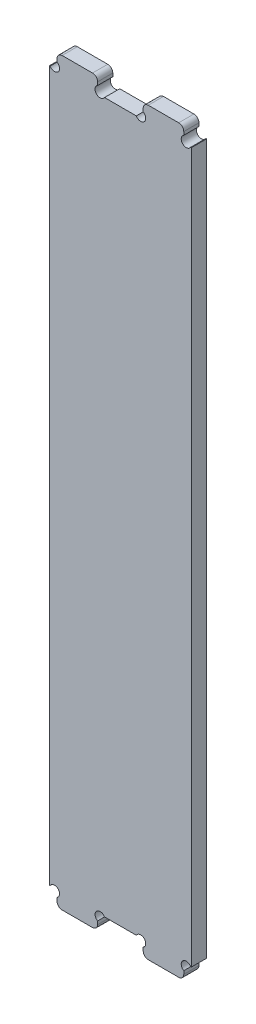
ISO-10303-21;
HEADER;
FILE_DESCRIPTION(('STEP AP214'),'2;1');
FILE_NAME('part.step','',(''),(''),'','','');
FILE_SCHEMA(('AUTOMOTIVE_DESIGN { 1 0 10303 214 1 1 1 1 }'));
ENDSEC;
DATA;
#1=APPLICATION_CONTEXT('core data for automotive mechanical design processes');
#2=APPLICATION_PROTOCOL_DEFINITION('international standard','automotive_design',2000,#1);
#3=PRODUCT_CONTEXT('',#1,'mechanical');
#4=PRODUCT('Part','Part','',(#3));
#5=PRODUCT_RELATED_PRODUCT_CATEGORY('part','',(#4));
#6=PRODUCT_DEFINITION_FORMATION('','',#4);
#7=PRODUCT_DEFINITION_CONTEXT('part definition',#1,'design');
#8=PRODUCT_DEFINITION('design','',#6,#7);
#9=PRODUCT_DEFINITION_SHAPE('','',#8);
#10=(LENGTH_UNIT() NAMED_UNIT(*) SI_UNIT(.MILLI.,.METRE.));
#11=(NAMED_UNIT(*) PLANE_ANGLE_UNIT() SI_UNIT($,.RADIAN.));
#12=(NAMED_UNIT(*) SI_UNIT($,.STERADIAN.) SOLID_ANGLE_UNIT());
#13=UNCERTAINTY_MEASURE_WITH_UNIT(LENGTH_MEASURE(1.E-05),#10,'distance_accuracy_value','');
#14=(GEOMETRIC_REPRESENTATION_CONTEXT(3) GLOBAL_UNCERTAINTY_ASSIGNED_CONTEXT((#13)) GLOBAL_UNIT_ASSIGNED_CONTEXT((#10,
#11,#12)) REPRESENTATION_CONTEXT('',''));
#15=CARTESIAN_POINT('',(0.,0.,0.));
#16=DIRECTION('',(0.,0.,1.));
#17=DIRECTION('',(1.,0.,0.));
#18=AXIS2_PLACEMENT_3D('',#15,#16,#17);
#19=CARTESIAN_POINT('',(0.,0.,3.));
#20=DIRECTION('',(0.,0.,-1.));
#21=DIRECTION('',(-1.,0.,0.));
#22=AXIS2_PLACEMENT_3D('',#19,#20,#21);
#23=PLANE('',#22);
#24=DIRECTION('',(1.,0.,0.));
#25=VECTOR('',#24,1.);
#26=CARTESIAN_POINT('',(12.5,-73.,3.));
#27=LINE('',#26,#25);
#28=CARTESIAN_POINT('',(5.5,-73.,3.));
#29=VERTEX_POINT('',#28);
#30=CARTESIAN_POINT('',(11.5,-73.,3.));
#31=VERTEX_POINT('',#30);
#32=EDGE_CURVE('E601',#29,#31,#27,.T.);
#33=ORIENTED_EDGE('',*,*,#32,.T.);
#34=CARTESIAN_POINT('',(11.5,-72.,3.));
#35=DIRECTION('',(0.,0.,-1.));
#36=DIRECTION('',(-1.,0.,0.));
#37=AXIS2_PLACEMENT_3D('',#34,#35,#36);
#38=CIRCLE('',#37,1.);
#39=CARTESIAN_POINT('',(12.5,-72.,3.));
#40=VERTEX_POINT('',#39);
#41=EDGE_CURVE('E382',#31,#40,#38,.F.);
#42=ORIENTED_EDGE('',*,*,#41,.T.);
#43=DIRECTION('',(0.,1.,0.));
#44=VECTOR('',#43,1.);
#45=CARTESIAN_POINT('',(12.5,-70.,3.));
#46=LINE('',#45,#44);
#47=CARTESIAN_POINT('',(12.5,-71.3660254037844,3.));
#48=VERTEX_POINT('',#47);
#49=EDGE_CURVE('E591',#40,#48,#46,.T.);
#50=ORIENTED_EDGE('',*,*,#49,.T.);
#51=CARTESIAN_POINT('',(13.,-70.5,3.));
#52=DIRECTION('',(0.,0.,1.));
#53=DIRECTION('',(1.,0.,0.));
#54=AXIS2_PLACEMENT_3D('',#51,#52,#53);
#55=CIRCLE('',#54,0.999999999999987);
#56=CARTESIAN_POINT('',(13.8660254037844,-70.,3.));
#57=VERTEX_POINT('',#56);
#58=EDGE_CURVE('E555',#57,#48,#55,.T.);
#59=ORIENTED_EDGE('',*,*,#58,.F.);
#60=DIRECTION('',(1.,0.,0.));
#61=VECTOR('',#60,1.);
#62=CARTESIAN_POINT('',(-14.,-70.,3.));
#63=LINE('',#62,#61);
#64=CARTESIAN_POINT('',(14.,-70.,3.));
#65=VERTEX_POINT('',#64);
#66=EDGE_CURVE('E320',#57,#65,#63,.T.);
#67=ORIENTED_EDGE('',*,*,#66,.T.);
#68=DIRECTION('',(0.,1.,0.));
#69=VECTOR('',#68,1.);
#70=CARTESIAN_POINT('',(14.,-70.,3.));
#71=LINE('',#70,#69);
#72=CARTESIAN_POINT('',(14.,70.,3.));
#73=VERTEX_POINT('',#72);
#74=EDGE_CURVE('E309',#65,#73,#71,.T.);
#75=ORIENTED_EDGE('',*,*,#74,.T.);
#76=DIRECTION('',(-1.,0.,0.));
#77=VECTOR('',#76,1.);
#78=CARTESIAN_POINT('',(-14.,70.,3.));
#79=LINE('',#78,#77);
#80=CARTESIAN_POINT('',(13.8660254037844,70.,3.));
#81=VERTEX_POINT('',#80);
#82=EDGE_CURVE('E314',#73,#81,#79,.T.);
#83=ORIENTED_EDGE('',*,*,#82,.T.);
#84=CARTESIAN_POINT('',(13.,70.5,3.));
#85=DIRECTION('',(0.,0.,1.));
#86=DIRECTION('',(1.,0.,0.));
#87=AXIS2_PLACEMENT_3D('',#84,#85,#86);
#88=CIRCLE('',#87,0.999999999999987);
#89=CARTESIAN_POINT('',(12.5,71.3660254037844,3.));
#90=VERTEX_POINT('',#89);
#91=EDGE_CURVE('E640',#90,#81,#88,.T.);
#92=ORIENTED_EDGE('',*,*,#91,.F.);
#93=DIRECTION('',(0.,1.,0.));
#94=VECTOR('',#93,1.);
#95=CARTESIAN_POINT('',(12.5,70.,3.));
#96=LINE('',#95,#94);
#97=CARTESIAN_POINT('',(12.5,72.,3.));
#98=VERTEX_POINT('',#97);
#99=EDGE_CURVE('E522',#90,#98,#96,.T.);
#100=ORIENTED_EDGE('',*,*,#99,.T.);
#101=CARTESIAN_POINT('',(11.5,72.,3.));
#102=DIRECTION('',(0.,0.,-1.));
#103=DIRECTION('',(-1.,0.,0.));
#104=AXIS2_PLACEMENT_3D('',#101,#102,#103);
#105=CIRCLE('',#104,1.);
#106=CARTESIAN_POINT('',(11.5,73.,3.));
#107=VERTEX_POINT('',#106);
#108=EDGE_CURVE('E374',#98,#107,#105,.F.);
#109=ORIENTED_EDGE('',*,*,#108,.T.);
#110=DIRECTION('',(-1.,0.,0.));
#111=VECTOR('',#110,1.);
#112=CARTESIAN_POINT('',(12.5,73.,3.));
#113=LINE('',#112,#111);
#114=CARTESIAN_POINT('',(5.5,73.,3.));
#115=VERTEX_POINT('',#114);
#116=EDGE_CURVE('E525',#107,#115,#113,.T.);
#117=ORIENTED_EDGE('',*,*,#116,.T.);
#118=CARTESIAN_POINT('',(5.5,72.,3.));
#119=DIRECTION('',(0.,0.,-1.));
#120=DIRECTION('',(-1.,0.,0.));
#121=AXIS2_PLACEMENT_3D('',#118,#119,#120);
#122=CIRCLE('',#121,1.);
#123=CARTESIAN_POINT('',(4.5,72.,3.));
#124=VERTEX_POINT('',#123);
#125=EDGE_CURVE('E372',#115,#124,#122,.F.);
#126=ORIENTED_EDGE('',*,*,#125,.T.);
#127=DIRECTION('',(0.,-1.,0.));
#128=VECTOR('',#127,1.);
#129=CARTESIAN_POINT('',(4.5,70.,3.));
#130=LINE('',#129,#128);
#131=CARTESIAN_POINT('',(4.5,71.3660254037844,3.));
#132=VERTEX_POINT('',#131);
#133=EDGE_CURVE('E518',#124,#132,#130,.T.);
#134=ORIENTED_EDGE('',*,*,#133,.T.);
#135=CARTESIAN_POINT('',(4.,70.5,3.));
#136=DIRECTION('',(0.,0.,1.));
#137=DIRECTION('',(1.,0.,0.));
#138=AXIS2_PLACEMENT_3D('',#135,#136,#137);
#139=CIRCLE('',#138,0.999999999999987);
#140=CARTESIAN_POINT('',(3.13397459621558,70.,3.));
#141=VERTEX_POINT('',#140);
#142=EDGE_CURVE('E531',#141,#132,#139,.T.);
#143=ORIENTED_EDGE('',*,*,#142,.F.);
#144=CARTESIAN_POINT('',(-3.13397459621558,70.,3.));
#145=VERTEX_POINT('',#144);
#146=EDGE_CURVE('E318',#141,#145,#79,.T.);
#147=ORIENTED_EDGE('',*,*,#146,.T.);
#148=CARTESIAN_POINT('',(-4.,70.5,3.));
#149=DIRECTION('',(0.,0.,1.));
#150=DIRECTION('',(1.,0.,0.));
#151=AXIS2_PLACEMENT_3D('',#148,#149,#150);
#152=CIRCLE('',#151,0.999999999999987);
#153=CARTESIAN_POINT('',(-4.5,71.3660254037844,3.));
#154=VERTEX_POINT('',#153);
#155=EDGE_CURVE('E279',#154,#145,#152,.T.);
#156=ORIENTED_EDGE('',*,*,#155,.F.);
#157=DIRECTION('',(0.,1.,0.));
#158=VECTOR('',#157,1.);
#159=CARTESIAN_POINT('',(-4.5,70.,3.));
#160=LINE('',#159,#158);
#161=CARTESIAN_POINT('',(-4.5,72.,3.));
#162=VERTEX_POINT('',#161);
#163=EDGE_CURVE('E288',#154,#162,#160,.T.);
#164=ORIENTED_EDGE('',*,*,#163,.T.);
#165=CARTESIAN_POINT('',(-5.5,72.,3.));
#166=DIRECTION('',(0.,0.,-1.));
#167=DIRECTION('',(-1.,0.,0.));
#168=AXIS2_PLACEMENT_3D('',#165,#166,#167);
#169=CIRCLE('',#168,1.);
#170=CARTESIAN_POINT('',(-5.5,73.,3.));
#171=VERTEX_POINT('',#170);
#172=EDGE_CURVE('E368',#162,#171,#169,.F.);
#173=ORIENTED_EDGE('',*,*,#172,.T.);
#174=DIRECTION('',(-1.,0.,0.));
#175=VECTOR('',#174,1.);
#176=CARTESIAN_POINT('',(-12.5,73.,3.));
#177=LINE('',#176,#175);
#178=CARTESIAN_POINT('',(-11.5,73.,3.));
#179=VERTEX_POINT('',#178);
#180=EDGE_CURVE('E299',#171,#179,#177,.T.);
#181=ORIENTED_EDGE('',*,*,#180,.T.);
#182=CARTESIAN_POINT('',(-11.5,72.,3.));
#183=DIRECTION('',(0.,0.,-1.));
#184=DIRECTION('',(-1.,0.,0.));
#185=AXIS2_PLACEMENT_3D('',#182,#183,#184);
#186=CIRCLE('',#185,1.);
#187=CARTESIAN_POINT('',(-12.5,72.,3.));
#188=VERTEX_POINT('',#187);
#189=EDGE_CURVE('E370',#179,#188,#186,.F.);
#190=ORIENTED_EDGE('',*,*,#189,.T.);
#191=DIRECTION('',(0.,-1.,0.));
#192=VECTOR('',#191,1.);
#193=CARTESIAN_POINT('',(-12.5,70.,3.));
#194=LINE('',#193,#192);
#195=CARTESIAN_POINT('',(-12.5,71.3660254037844,3.));
#196=VERTEX_POINT('',#195);
#197=EDGE_CURVE('E303',#188,#196,#194,.T.);
#198=ORIENTED_EDGE('',*,*,#197,.T.);
#199=CARTESIAN_POINT('',(-13.,70.5,3.));
#200=DIRECTION('',(0.,0.,1.));
#201=DIRECTION('',(1.,0.,0.));
#202=AXIS2_PLACEMENT_3D('',#199,#200,#201);
#203=CIRCLE('',#202,0.999999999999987);
#204=CARTESIAN_POINT('',(-13.8660254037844,70.,3.));
#205=VERTEX_POINT('',#204);
#206=EDGE_CURVE('E661',#205,#196,#203,.T.);
#207=ORIENTED_EDGE('',*,*,#206,.F.);
#208=CARTESIAN_POINT('',(-14.,70.,3.));
#209=VERTEX_POINT('',#208);
#210=EDGE_CURVE('E312',#205,#209,#79,.T.);
#211=ORIENTED_EDGE('',*,*,#210,.T.);
#212=DIRECTION('',(0.,-1.,0.));
#213=VECTOR('',#212,1.);
#214=CARTESIAN_POINT('',(-14.,-70.,3.));
#215=LINE('',#214,#213);
#216=CARTESIAN_POINT('',(-14.,-70.,3.));
#217=VERTEX_POINT('',#216);
#218=EDGE_CURVE('E317',#209,#217,#215,.T.);
#219=ORIENTED_EDGE('',*,*,#218,.T.);
#220=CARTESIAN_POINT('',(-13.8660254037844,-70.,3.));
#221=VERTEX_POINT('',#220);
#222=EDGE_CURVE('E321',#217,#221,#63,.T.);
#223=ORIENTED_EDGE('',*,*,#222,.T.);
#224=CARTESIAN_POINT('',(-13.,-70.5,3.));
#225=DIRECTION('',(0.,0.,1.));
#226=DIRECTION('',(1.,0.,0.));
#227=AXIS2_PLACEMENT_3D('',#224,#225,#226);
#228=CIRCLE('',#227,0.999999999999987);
#229=CARTESIAN_POINT('',(-12.5,-71.3660254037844,3.));
#230=VERTEX_POINT('',#229);
#231=EDGE_CURVE('E353',#230,#221,#228,.T.);
#232=ORIENTED_EDGE('',*,*,#231,.F.);
#233=DIRECTION('',(0.,-1.,0.));
#234=VECTOR('',#233,1.);
#235=CARTESIAN_POINT('',(-12.5,-70.,3.));
#236=LINE('',#235,#234);
#237=CARTESIAN_POINT('',(-12.5,-72.,3.));
#238=VERTEX_POINT('',#237);
#239=EDGE_CURVE('E581',#230,#238,#236,.T.);
#240=ORIENTED_EDGE('',*,*,#239,.T.);
#241=CARTESIAN_POINT('',(-11.5,-72.,3.));
#242=DIRECTION('',(0.,0.,-1.));
#243=DIRECTION('',(-1.,0.,0.));
#244=AXIS2_PLACEMENT_3D('',#241,#242,#243);
#245=CIRCLE('',#244,1.);
#246=CARTESIAN_POINT('',(-11.5,-73.,3.));
#247=VERTEX_POINT('',#246);
#248=EDGE_CURVE('E376',#238,#247,#245,.F.);
#249=ORIENTED_EDGE('',*,*,#248,.T.);
#250=DIRECTION('',(1.,0.,0.));
#251=VECTOR('',#250,1.);
#252=CARTESIAN_POINT('',(-12.5,-73.,3.));
#253=LINE('',#252,#251);
#254=CARTESIAN_POINT('',(-5.5,-73.,3.));
#255=VERTEX_POINT('',#254);
#256=EDGE_CURVE('E594',#247,#255,#253,.T.);
#257=ORIENTED_EDGE('',*,*,#256,.T.);
#258=CARTESIAN_POINT('',(-5.5,-72.,3.));
#259=DIRECTION('',(0.,0.,-1.));
#260=DIRECTION('',(-1.,0.,0.));
#261=AXIS2_PLACEMENT_3D('',#258,#259,#260);
#262=CIRCLE('',#261,1.);
#263=CARTESIAN_POINT('',(-4.5,-72.,3.));
#264=VERTEX_POINT('',#263);
#265=EDGE_CURVE('E378',#255,#264,#262,.F.);
#266=ORIENTED_EDGE('',*,*,#265,.T.);
#267=DIRECTION('',(0.,1.,0.));
#268=VECTOR('',#267,1.);
#269=CARTESIAN_POINT('',(-4.5,-70.,3.));
#270=LINE('',#269,#268);
#271=CARTESIAN_POINT('',(-4.5,-71.3660254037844,3.));
#272=VERTEX_POINT('',#271);
#273=EDGE_CURVE('E586',#264,#272,#270,.T.);
#274=ORIENTED_EDGE('',*,*,#273,.T.);
#275=CARTESIAN_POINT('',(-4.,-70.5,3.));
#276=DIRECTION('',(0.,0.,1.));
#277=DIRECTION('',(1.,0.,0.));
#278=AXIS2_PLACEMENT_3D('',#275,#276,#277);
#279=CIRCLE('',#278,0.999999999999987);
#280=CARTESIAN_POINT('',(-3.13397459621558,-70.,3.));
#281=VERTEX_POINT('',#280);
#282=EDGE_CURVE('E572',#281,#272,#279,.T.);
#283=ORIENTED_EDGE('',*,*,#282,.F.);
#284=CARTESIAN_POINT('',(3.13397459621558,-70.,3.));
#285=VERTEX_POINT('',#284);
#286=EDGE_CURVE('E325',#281,#285,#63,.T.);
#287=ORIENTED_EDGE('',*,*,#286,.T.);
#288=CARTESIAN_POINT('',(4.,-70.5,3.));
#289=DIRECTION('',(0.,0.,1.));
#290=DIRECTION('',(1.,0.,0.));
#291=AXIS2_PLACEMENT_3D('',#288,#289,#290);
#292=CIRCLE('',#291,0.999999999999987);
#293=CARTESIAN_POINT('',(4.5,-71.3660254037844,3.));
#294=VERTEX_POINT('',#293);
#295=EDGE_CURVE('E357',#294,#285,#292,.T.);
#296=ORIENTED_EDGE('',*,*,#295,.F.);
#297=DIRECTION('',(0.,-1.,0.));
#298=VECTOR('',#297,1.);
#299=CARTESIAN_POINT('',(4.5,-70.,3.));
#300=LINE('',#299,#298);
#301=CARTESIAN_POINT('',(4.5,-72.,3.));
#302=VERTEX_POINT('',#301);
#303=EDGE_CURVE('E607',#294,#302,#300,.T.);
#304=ORIENTED_EDGE('',*,*,#303,.T.);
#305=CARTESIAN_POINT('',(5.5,-72.,3.));
#306=DIRECTION('',(0.,0.,-1.));
#307=DIRECTION('',(-1.,0.,0.));
#308=AXIS2_PLACEMENT_3D('',#305,#306,#307);
#309=CIRCLE('',#308,1.);
#310=EDGE_CURVE('E380',#302,#29,#309,.F.);
#311=ORIENTED_EDGE('',*,*,#310,.T.);
#312=EDGE_LOOP('',(#33,#42,#50,#59,#67,#75,#83,#92,#100,#109,#117,#126,#134,#143,#147,#156,#164,
#173,#181,#190,#198,#207,#211,#219,#223,#232,#240,#249,#257,#266,#274,#283,#287,#296,#304,#311));
#313=FACE_BOUND('',#312,.T.);
#314=ADVANCED_FACE('F35',(#313),#23,.F.);
#315=CARTESIAN_POINT('',(0.,0.,0.));
#316=DIRECTION('',(0.,0.,-1.));
#317=DIRECTION('',(-1.,0.,0.));
#318=AXIS2_PLACEMENT_3D('',#315,#316,#317);
#319=PLANE('',#318);
#320=DIRECTION('',(0.,1.,0.));
#321=VECTOR('',#320,1.);
#322=CARTESIAN_POINT('',(12.5,-70.,0.));
#323=LINE('',#322,#321);
#324=CARTESIAN_POINT('',(12.5,-72.,0.));
#325=VERTEX_POINT('',#324);
#326=CARTESIAN_POINT('',(12.5,-71.3660254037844,0.));
#327=VERTEX_POINT('',#326);
#328=EDGE_CURVE('E598',#325,#327,#323,.T.);
#329=ORIENTED_EDGE('',*,*,#328,.F.);
#330=CARTESIAN_POINT('',(11.5,-72.,0.));
#331=DIRECTION('',(0.,0.,-1.));
#332=DIRECTION('',(-1.,0.,0.));
#333=AXIS2_PLACEMENT_3D('',#330,#331,#332);
#334=CIRCLE('',#333,1.);
#335=CARTESIAN_POINT('',(11.5,-73.,0.));
#336=VERTEX_POINT('',#335);
#337=EDGE_CURVE('E398',#325,#336,#334,.T.);
#338=ORIENTED_EDGE('',*,*,#337,.T.);
#339=DIRECTION('',(1.,0.,0.));
#340=VECTOR('',#339,1.);
#341=CARTESIAN_POINT('',(12.5,-73.,0.));
#342=LINE('',#341,#340);
#343=CARTESIAN_POINT('',(5.5,-73.,0.));
#344=VERTEX_POINT('',#343);
#345=EDGE_CURVE('E526',#344,#336,#342,.T.);
#346=ORIENTED_EDGE('',*,*,#345,.F.);
#347=CARTESIAN_POINT('',(5.5,-72.,0.));
#348=DIRECTION('',(0.,0.,-1.));
#349=DIRECTION('',(-1.,0.,0.));
#350=AXIS2_PLACEMENT_3D('',#347,#348,#349);
#351=CIRCLE('',#350,1.);
#352=CARTESIAN_POINT('',(4.5,-72.,0.));
#353=VERTEX_POINT('',#352);
#354=EDGE_CURVE('E396',#344,#353,#351,.T.);
#355=ORIENTED_EDGE('',*,*,#354,.T.);
#356=DIRECTION('',(0.,-1.,0.));
#357=VECTOR('',#356,1.);
#358=CARTESIAN_POINT('',(4.5,-70.,0.));
#359=LINE('',#358,#357);
#360=CARTESIAN_POINT('',(4.5,-71.3660254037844,0.));
#361=VERTEX_POINT('',#360);
#362=EDGE_CURVE('E600',#361,#353,#359,.T.);
#363=ORIENTED_EDGE('',*,*,#362,.F.);
#364=CARTESIAN_POINT('',(4.,-70.5,0.));
#365=DIRECTION('',(0.,0.,1.));
#366=DIRECTION('',(1.,0.,0.));
#367=AXIS2_PLACEMENT_3D('',#364,#365,#366);
#368=CIRCLE('',#367,0.999999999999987);
#369=CARTESIAN_POINT('',(3.13397459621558,-70.,0.));
#370=VERTEX_POINT('',#369);
#371=EDGE_CURVE('E545',#361,#370,#368,.T.);
#372=ORIENTED_EDGE('',*,*,#371,.T.);
#373=DIRECTION('',(1.,0.,0.));
#374=VECTOR('',#373,1.);
#375=CARTESIAN_POINT('',(-14.,-70.,0.));
#376=LINE('',#375,#374);
#377=CARTESIAN_POINT('',(-3.13397459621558,-70.,0.));
#378=VERTEX_POINT('',#377);
#379=EDGE_CURVE('E338',#378,#370,#376,.T.);
#380=ORIENTED_EDGE('',*,*,#379,.F.);
#381=CARTESIAN_POINT('',(-4.,-70.5,0.));
#382=DIRECTION('',(0.,0.,1.));
#383=DIRECTION('',(1.,0.,0.));
#384=AXIS2_PLACEMENT_3D('',#381,#382,#383);
#385=CIRCLE('',#384,0.999999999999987);
#386=CARTESIAN_POINT('',(-4.5,-71.3660254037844,0.));
#387=VERTEX_POINT('',#386);
#388=EDGE_CURVE('E575',#378,#387,#385,.T.);
#389=ORIENTED_EDGE('',*,*,#388,.T.);
#390=DIRECTION('',(0.,1.,0.));
#391=VECTOR('',#390,1.);
#392=CARTESIAN_POINT('',(-4.5,-70.,0.));
#393=LINE('',#392,#391);
#394=CARTESIAN_POINT('',(-4.5,-72.,0.));
#395=VERTEX_POINT('',#394);
#396=EDGE_CURVE('E589',#395,#387,#393,.T.);
#397=ORIENTED_EDGE('',*,*,#396,.F.);
#398=CARTESIAN_POINT('',(-5.5,-72.,0.));
#399=DIRECTION('',(0.,0.,-1.));
#400=DIRECTION('',(-1.,0.,0.));
#401=AXIS2_PLACEMENT_3D('',#398,#399,#400);
#402=CIRCLE('',#401,1.);
#403=CARTESIAN_POINT('',(-5.5,-73.,0.));
#404=VERTEX_POINT('',#403);
#405=EDGE_CURVE('E394',#395,#404,#402,.T.);
#406=ORIENTED_EDGE('',*,*,#405,.T.);
#407=DIRECTION('',(1.,0.,0.));
#408=VECTOR('',#407,1.);
#409=CARTESIAN_POINT('',(-12.5,-73.,0.));
#410=LINE('',#409,#408);
#411=CARTESIAN_POINT('',(-11.5,-73.,0.));
#412=VERTEX_POINT('',#411);
#413=EDGE_CURVE('E585',#412,#404,#410,.T.);
#414=ORIENTED_EDGE('',*,*,#413,.F.);
#415=CARTESIAN_POINT('',(-11.5,-72.,0.));
#416=DIRECTION('',(0.,0.,-1.));
#417=DIRECTION('',(-1.,0.,0.));
#418=AXIS2_PLACEMENT_3D('',#415,#416,#417);
#419=CIRCLE('',#418,1.);
#420=CARTESIAN_POINT('',(-12.5,-72.,0.));
#421=VERTEX_POINT('',#420);
#422=EDGE_CURVE('E392',#412,#421,#419,.T.);
#423=ORIENTED_EDGE('',*,*,#422,.T.);
#424=DIRECTION('',(0.,-1.,0.));
#425=VECTOR('',#424,1.);
#426=CARTESIAN_POINT('',(-12.5,-70.,0.));
#427=LINE('',#426,#425);
#428=CARTESIAN_POINT('',(-12.5,-71.3660254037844,0.));
#429=VERTEX_POINT('',#428);
#430=EDGE_CURVE('E582',#429,#421,#427,.T.);
#431=ORIENTED_EDGE('',*,*,#430,.F.);
#432=CARTESIAN_POINT('',(-13.,-70.5,0.));
#433=DIRECTION('',(0.,0.,1.));
#434=DIRECTION('',(1.,0.,0.));
#435=AXIS2_PLACEMENT_3D('',#432,#433,#434);
#436=CIRCLE('',#435,0.999999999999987);
#437=CARTESIAN_POINT('',(-13.8660254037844,-70.,0.));
#438=VERTEX_POINT('',#437);
#439=EDGE_CURVE('E358',#429,#438,#436,.T.);
#440=ORIENTED_EDGE('',*,*,#439,.T.);
#441=CARTESIAN_POINT('',(-14.,-70.,0.));
#442=VERTEX_POINT('',#441);
#443=EDGE_CURVE('E313',#442,#438,#376,.T.);
#444=ORIENTED_EDGE('',*,*,#443,.F.);
#445=DIRECTION('',(0.,-1.,0.));
#446=VECTOR('',#445,1.);
#447=CARTESIAN_POINT('',(-14.,-70.,0.));
#448=LINE('',#447,#446);
#449=CARTESIAN_POINT('',(-14.,70.,0.));
#450=VERTEX_POINT('',#449);
#451=EDGE_CURVE('E332',#450,#442,#448,.T.);
#452=ORIENTED_EDGE('',*,*,#451,.F.);
#453=DIRECTION('',(-1.,0.,0.));
#454=VECTOR('',#453,1.);
#455=CARTESIAN_POINT('',(-14.,70.,0.));
#456=LINE('',#455,#454);
#457=CARTESIAN_POINT('',(-13.8660254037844,70.,0.));
#458=VERTEX_POINT('',#457);
#459=EDGE_CURVE('E328',#458,#450,#456,.T.);
#460=ORIENTED_EDGE('',*,*,#459,.F.);
#461=CARTESIAN_POINT('',(-13.,70.5,0.));
#462=DIRECTION('',(0.,0.,1.));
#463=DIRECTION('',(1.,0.,0.));
#464=AXIS2_PLACEMENT_3D('',#461,#462,#463);
#465=CIRCLE('',#464,0.999999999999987);
#466=CARTESIAN_POINT('',(-12.5,71.3660254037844,0.));
#467=VERTEX_POINT('',#466);
#468=EDGE_CURVE('E365',#458,#467,#465,.T.);
#469=ORIENTED_EDGE('',*,*,#468,.T.);
#470=DIRECTION('',(0.,-1.,0.));
#471=VECTOR('',#470,1.);
#472=CARTESIAN_POINT('',(-12.5,70.,0.));
#473=LINE('',#472,#471);
#474=CARTESIAN_POINT('',(-12.5,72.,0.));
#475=VERTEX_POINT('',#474);
#476=EDGE_CURVE('E295',#475,#467,#473,.T.);
#477=ORIENTED_EDGE('',*,*,#476,.F.);
#478=CARTESIAN_POINT('',(-11.5,72.,0.));
#479=DIRECTION('',(0.,0.,-1.));
#480=DIRECTION('',(-1.,0.,0.));
#481=AXIS2_PLACEMENT_3D('',#478,#479,#480);
#482=CIRCLE('',#481,1.);
#483=CARTESIAN_POINT('',(-11.5,73.,0.));
#484=VERTEX_POINT('',#483);
#485=EDGE_CURVE('E50',#475,#484,#482,.T.);
#486=ORIENTED_EDGE('',*,*,#485,.T.);
#487=DIRECTION('',(-1.,0.,0.));
#488=VECTOR('',#487,1.);
#489=CARTESIAN_POINT('',(-12.5,73.,0.));
#490=LINE('',#489,#488);
#491=CARTESIAN_POINT('',(-5.5,73.,0.));
#492=VERTEX_POINT('',#491);
#493=EDGE_CURVE('E294',#492,#484,#490,.T.);
#494=ORIENTED_EDGE('',*,*,#493,.F.);
#495=CARTESIAN_POINT('',(-5.5,72.,0.));
#496=DIRECTION('',(0.,0.,-1.));
#497=DIRECTION('',(-1.,0.,0.));
#498=AXIS2_PLACEMENT_3D('',#495,#496,#497);
#499=CIRCLE('',#498,1.);
#500=CARTESIAN_POINT('',(-4.5,72.,0.));
#501=VERTEX_POINT('',#500);
#502=EDGE_CURVE('E293',#492,#501,#499,.T.);
#503=ORIENTED_EDGE('',*,*,#502,.T.);
#504=DIRECTION('',(0.,1.,0.));
#505=VECTOR('',#504,1.);
#506=CARTESIAN_POINT('',(-4.5,70.,0.));
#507=LINE('',#506,#505);
#508=CARTESIAN_POINT('',(-4.5,71.3660254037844,0.));
#509=VERTEX_POINT('',#508);
#510=EDGE_CURVE('E285',#509,#501,#507,.T.);
#511=ORIENTED_EDGE('',*,*,#510,.F.);
#512=CARTESIAN_POINT('',(-4.,70.5,0.));
#513=DIRECTION('',(0.,0.,1.));
#514=DIRECTION('',(1.,0.,0.));
#515=AXIS2_PLACEMENT_3D('',#512,#513,#514);
#516=CIRCLE('',#515,0.999999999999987);
#517=CARTESIAN_POINT('',(-3.13397459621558,70.,0.));
#518=VERTEX_POINT('',#517);
#519=EDGE_CURVE('E269',#509,#518,#516,.T.);
#520=ORIENTED_EDGE('',*,*,#519,.T.);
#521=CARTESIAN_POINT('',(3.13397459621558,70.,0.));
#522=VERTEX_POINT('',#521);
#523=EDGE_CURVE('E333',#522,#518,#456,.T.);
#524=ORIENTED_EDGE('',*,*,#523,.F.);
#525=CARTESIAN_POINT('',(4.,70.5,0.));
#526=DIRECTION('',(0.,0.,1.));
#527=DIRECTION('',(1.,0.,0.));
#528=AXIS2_PLACEMENT_3D('',#525,#526,#527);
#529=CIRCLE('',#528,0.999999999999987);
#530=CARTESIAN_POINT('',(4.5,71.3660254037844,0.));
#531=VERTEX_POINT('',#530);
#532=EDGE_CURVE('E361',#522,#531,#529,.T.);
#533=ORIENTED_EDGE('',*,*,#532,.T.);
#534=DIRECTION('',(0.,-1.,0.));
#535=VECTOR('',#534,1.);
#536=CARTESIAN_POINT('',(4.5,70.,0.));
#537=LINE('',#536,#535);
#538=CARTESIAN_POINT('',(4.5,72.,0.));
#539=VERTEX_POINT('',#538);
#540=EDGE_CURVE('E305',#539,#531,#537,.T.);
#541=ORIENTED_EDGE('',*,*,#540,.F.);
#542=CARTESIAN_POINT('',(5.5,72.,0.));
#543=DIRECTION('',(0.,0.,-1.));
#544=DIRECTION('',(-1.,0.,0.));
#545=AXIS2_PLACEMENT_3D('',#542,#543,#544);
#546=CIRCLE('',#545,1.);
#547=CARTESIAN_POINT('',(5.5,73.,0.));
#548=VERTEX_POINT('',#547);
#549=EDGE_CURVE('E388',#539,#548,#546,.T.);
#550=ORIENTED_EDGE('',*,*,#549,.T.);
#551=DIRECTION('',(-1.,0.,0.));
#552=VECTOR('',#551,1.);
#553=CARTESIAN_POINT('',(12.5,73.,0.));
#554=LINE('',#553,#552);
#555=CARTESIAN_POINT('',(11.5,73.,0.));
#556=VERTEX_POINT('',#555);
#557=EDGE_CURVE('E506',#556,#548,#554,.T.);
#558=ORIENTED_EDGE('',*,*,#557,.F.);
#559=CARTESIAN_POINT('',(11.5,72.,0.));
#560=DIRECTION('',(0.,0.,-1.));
#561=DIRECTION('',(-1.,0.,0.));
#562=AXIS2_PLACEMENT_3D('',#559,#560,#561);
#563=CIRCLE('',#562,1.);
#564=CARTESIAN_POINT('',(12.5,72.,0.));
#565=VERTEX_POINT('',#564);
#566=EDGE_CURVE('E390',#556,#565,#563,.T.);
#567=ORIENTED_EDGE('',*,*,#566,.T.);
#568=DIRECTION('',(0.,1.,0.));
#569=VECTOR('',#568,1.);
#570=CARTESIAN_POINT('',(12.5,70.,0.));
#571=LINE('',#570,#569);
#572=CARTESIAN_POINT('',(12.5,71.3660254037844,0.));
#573=VERTEX_POINT('',#572);
#574=EDGE_CURVE('E514',#573,#565,#571,.T.);
#575=ORIENTED_EDGE('',*,*,#574,.F.);
#576=CARTESIAN_POINT('',(13.,70.5,0.));
#577=DIRECTION('',(0.,0.,1.));
#578=DIRECTION('',(1.,0.,0.));
#579=AXIS2_PLACEMENT_3D('',#576,#577,#578);
#580=CIRCLE('',#579,0.999999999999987);
#581=CARTESIAN_POINT('',(13.8660254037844,70.,0.));
#582=VERTEX_POINT('',#581);
#583=EDGE_CURVE('E643',#573,#582,#580,.T.);
#584=ORIENTED_EDGE('',*,*,#583,.T.);
#585=CARTESIAN_POINT('',(14.,70.,0.));
#586=VERTEX_POINT('',#585);
#587=EDGE_CURVE('E329',#586,#582,#456,.T.);
#588=ORIENTED_EDGE('',*,*,#587,.F.);
#589=DIRECTION('',(0.,1.,0.));
#590=VECTOR('',#589,1.);
#591=CARTESIAN_POINT('',(14.,-70.,0.));
#592=LINE('',#591,#590);
#593=CARTESIAN_POINT('',(14.,-70.,0.));
#594=VERTEX_POINT('',#593);
#595=EDGE_CURVE('E297',#594,#586,#592,.T.);
#596=ORIENTED_EDGE('',*,*,#595,.F.);
#597=CARTESIAN_POINT('',(13.8660254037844,-70.,0.));
#598=VERTEX_POINT('',#597);
#599=EDGE_CURVE('E335',#598,#594,#376,.T.);
#600=ORIENTED_EDGE('',*,*,#599,.F.);
#601=CARTESIAN_POINT('',(13.,-70.5,0.));
#602=DIRECTION('',(0.,0.,1.));
#603=DIRECTION('',(1.,0.,0.));
#604=AXIS2_PLACEMENT_3D('',#601,#602,#603);
#605=CIRCLE('',#604,0.999999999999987);
#606=EDGE_CURVE('E558',#598,#327,#605,.T.);
#607=ORIENTED_EDGE('',*,*,#606,.T.);
#608=EDGE_LOOP('',(#329,#338,#346,#355,#363,#372,#380,#389,#397,#406,#414,#423,#431,#440,#444,
#452,#460,#469,#477,#486,#494,#503,#511,#520,#524,#533,#541,#550,#558,#567,#575,#584,#588,#596,
#600,#607));
#609=FACE_BOUND('',#608,.T.);
#610=ADVANCED_FACE('F291',(#609),#319,.T.);
#611=CARTESIAN_POINT('',(-14.,-70.,3.));
#612=DIRECTION('',(0.,1.,0.));
#613=DIRECTION('',(0.,0.,1.));
#614=AXIS2_PLACEMENT_3D('',#611,#612,#613);
#615=PLANE('',#614);
#616=ORIENTED_EDGE('',*,*,#379,.T.);
#617=DIRECTION('',(0.,0.,1.));
#618=VECTOR('',#617,1.);
#619=CARTESIAN_POINT('',(3.13397459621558,-70.,3.));
#620=LINE('',#619,#618);
#621=EDGE_CURVE('E552',#370,#285,#620,.T.);
#622=ORIENTED_EDGE('',*,*,#621,.T.);
#623=ORIENTED_EDGE('',*,*,#286,.F.);
#624=DIRECTION('',(0.,0.,1.));
#625=VECTOR('',#624,1.);
#626=CARTESIAN_POINT('',(-3.13397459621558,-70.,3.));
#627=LINE('',#626,#625);
#628=EDGE_CURVE('E350',#281,#378,#627,.F.);
#629=ORIENTED_EDGE('',*,*,#628,.T.);
#630=EDGE_LOOP('',(#616,#622,#623,#629));
#631=FACE_BOUND('',#630,.T.);
#632=ADVANCED_FACE('F452',(#631),#615,.F.);
#633=ORIENTED_EDGE('',*,*,#66,.F.);
#634=DIRECTION('',(0.,0.,1.));
#635=VECTOR('',#634,1.);
#636=CARTESIAN_POINT('',(13.8660254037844,-70.,3.));
#637=LINE('',#636,#635);
#638=EDGE_CURVE('E561',#57,#598,#637,.F.);
#639=ORIENTED_EDGE('',*,*,#638,.T.);
#640=ORIENTED_EDGE('',*,*,#599,.T.);
#641=DIRECTION('',(0.,0.,-1.));
#642=VECTOR('',#641,1.);
#643=CARTESIAN_POINT('',(14.,-70.,3.));
#644=LINE('',#643,#642);
#645=EDGE_CURVE('E324',#65,#594,#644,.T.);
#646=ORIENTED_EDGE('',*,*,#645,.F.);
#647=EDGE_LOOP('',(#633,#639,#640,#646));
#648=FACE_BOUND('',#647,.T.);
#649=ADVANCED_FACE('F462',(#648),#615,.F.);
#650=CARTESIAN_POINT('',(-14.,70.,3.));
#651=DIRECTION('',(0.,-1.,0.));
#652=DIRECTION('',(0.,0.,-1.));
#653=AXIS2_PLACEMENT_3D('',#650,#651,#652);
#654=PLANE('',#653);
#655=ORIENTED_EDGE('',*,*,#523,.T.);
#656=DIRECTION('',(0.,0.,1.));
#657=VECTOR('',#656,1.);
#658=CARTESIAN_POINT('',(-3.13397459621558,70.,3.));
#659=LINE('',#658,#657);
#660=EDGE_CURVE('E275',#518,#145,#659,.T.);
#661=ORIENTED_EDGE('',*,*,#660,.T.);
#662=ORIENTED_EDGE('',*,*,#146,.F.);
#663=DIRECTION('',(0.,0.,1.));
#664=VECTOR('',#663,1.);
#665=CARTESIAN_POINT('',(3.13397459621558,70.,3.));
#666=LINE('',#665,#664);
#667=EDGE_CURVE('E540',#141,#522,#666,.F.);
#668=ORIENTED_EDGE('',*,*,#667,.T.);
#669=EDGE_LOOP('',(#655,#661,#662,#668));
#670=FACE_BOUND('',#669,.T.);
#671=ADVANCED_FACE('F471',(#670),#654,.F.);
#672=ORIENTED_EDGE('',*,*,#210,.F.);
#673=DIRECTION('',(0.,0.,1.));
#674=VECTOR('',#673,1.);
#675=CARTESIAN_POINT('',(-13.8660254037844,70.,3.));
#676=LINE('',#675,#674);
#677=EDGE_CURVE('E644',#205,#458,#676,.F.);
#678=ORIENTED_EDGE('',*,*,#677,.T.);
#679=ORIENTED_EDGE('',*,*,#459,.T.);
#680=DIRECTION('',(0.,0.,-1.));
#681=VECTOR('',#680,1.);
#682=CARTESIAN_POINT('',(-14.,70.,3.));
#683=LINE('',#682,#681);
#684=EDGE_CURVE('E344',#209,#450,#683,.T.);
#685=ORIENTED_EDGE('',*,*,#684,.F.);
#686=EDGE_LOOP('',(#672,#678,#679,#685));
#687=FACE_BOUND('',#686,.T.);
#688=ADVANCED_FACE('F472',(#687),#654,.F.);
#689=CARTESIAN_POINT('',(14.,-70.,3.));
#690=DIRECTION('',(-1.,0.,0.));
#691=DIRECTION('',(0.,0.,1.));
#692=AXIS2_PLACEMENT_3D('',#689,#690,#691);
#693=PLANE('',#692);
#694=ORIENTED_EDGE('',*,*,#595,.T.);
#695=DIRECTION('',(0.,0.,-1.));
#696=VECTOR('',#695,1.);
#697=CARTESIAN_POINT('',(14.,70.,3.));
#698=LINE('',#697,#696);
#699=EDGE_CURVE('E347',#73,#586,#698,.T.);
#700=ORIENTED_EDGE('',*,*,#699,.F.);
#701=ORIENTED_EDGE('',*,*,#74,.F.);
#702=ORIENTED_EDGE('',*,*,#645,.T.);
#703=EDGE_LOOP('',(#694,#700,#701,#702));
#704=FACE_BOUND('',#703,.T.);
#705=ADVANCED_FACE('F469',(#704),#693,.F.);
#706=ORIENTED_EDGE('',*,*,#587,.T.);
#707=DIRECTION('',(0.,0.,1.));
#708=VECTOR('',#707,1.);
#709=CARTESIAN_POINT('',(13.8660254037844,70.,3.));
#710=LINE('',#709,#708);
#711=EDGE_CURVE('E541',#582,#81,#710,.T.);
#712=ORIENTED_EDGE('',*,*,#711,.T.);
#713=ORIENTED_EDGE('',*,*,#82,.F.);
#714=ORIENTED_EDGE('',*,*,#699,.T.);
#715=EDGE_LOOP('',(#706,#712,#713,#714));
#716=FACE_BOUND('',#715,.T.);
#717=ADVANCED_FACE('F465',(#716),#654,.F.);
#718=CARTESIAN_POINT('',(-14.,-70.,3.));
#719=DIRECTION('',(1.,0.,0.));
#720=DIRECTION('',(0.,0.,-1.));
#721=AXIS2_PLACEMENT_3D('',#718,#719,#720);
#722=PLANE('',#721);
#723=ORIENTED_EDGE('',*,*,#451,.T.);
#724=DIRECTION('',(0.,0.,-1.));
#725=VECTOR('',#724,1.);
#726=CARTESIAN_POINT('',(-14.,-70.,3.));
#727=LINE('',#726,#725);
#728=EDGE_CURVE('E341',#217,#442,#727,.T.);
#729=ORIENTED_EDGE('',*,*,#728,.F.);
#730=ORIENTED_EDGE('',*,*,#218,.F.);
#731=ORIENTED_EDGE('',*,*,#684,.T.);
#732=EDGE_LOOP('',(#723,#729,#730,#731));
#733=FACE_BOUND('',#732,.T.);
#734=ADVANCED_FACE('F460',(#733),#722,.F.);
#735=ORIENTED_EDGE('',*,*,#443,.T.);
#736=DIRECTION('',(0.,0.,1.));
#737=VECTOR('',#736,1.);
#738=CARTESIAN_POINT('',(-13.8660254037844,-70.,3.));
#739=LINE('',#738,#737);
#740=EDGE_CURVE('E569',#438,#221,#739,.T.);
#741=ORIENTED_EDGE('',*,*,#740,.T.);
#742=ORIENTED_EDGE('',*,*,#222,.F.);
#743=ORIENTED_EDGE('',*,*,#728,.T.);
#744=EDGE_LOOP('',(#735,#741,#742,#743));
#745=FACE_BOUND('',#744,.T.);
#746=ADVANCED_FACE('F457',(#745),#615,.F.);
#747=CARTESIAN_POINT('',(-12.5,70.,0.));
#748=DIRECTION('',(-1.,0.,0.));
#749=DIRECTION('',(0.,0.,1.));
#750=AXIS2_PLACEMENT_3D('',#747,#748,#749);
#751=PLANE('',#750);
#752=ORIENTED_EDGE('',*,*,#197,.F.);
#753=DIRECTION('',(0.,0.,1.));
#754=VECTOR('',#753,1.);
#755=CARTESIAN_POINT('',(-12.5,72.,0.));
#756=LINE('',#755,#754);
#757=EDGE_CURVE('E43',#188,#475,#756,.F.);
#758=ORIENTED_EDGE('',*,*,#757,.T.);
#759=ORIENTED_EDGE('',*,*,#476,.T.);
#760=DIRECTION('',(0.,0.,1.));
#761=VECTOR('',#760,1.);
#762=CARTESIAN_POINT('',(-12.5,71.3660254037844,3.));
#763=LINE('',#762,#761);
#764=EDGE_CURVE('E659',#196,#467,#763,.F.);
#765=ORIENTED_EDGE('',*,*,#764,.F.);
#766=EDGE_LOOP('',(#752,#758,#759,#765));
#767=FACE_BOUND('',#766,.T.);
#768=ADVANCED_FACE('F429',(#767),#751,.T.);
#769=CARTESIAN_POINT('',(-12.5,73.,0.));
#770=DIRECTION('',(0.,1.,0.));
#771=DIRECTION('',(0.,0.,1.));
#772=AXIS2_PLACEMENT_3D('',#769,#770,#771);
#773=PLANE('',#772);
#774=ORIENTED_EDGE('',*,*,#493,.T.);
#775=DIRECTION('',(0.,0.,1.));
#776=VECTOR('',#775,1.);
#777=CARTESIAN_POINT('',(-11.5,73.,0.));
#778=LINE('',#777,#776);
#779=EDGE_CURVE('E424',#484,#179,#778,.T.);
#780=ORIENTED_EDGE('',*,*,#779,.T.);
#781=ORIENTED_EDGE('',*,*,#180,.F.);
#782=DIRECTION('',(0.,0.,1.));
#783=VECTOR('',#782,1.);
#784=CARTESIAN_POINT('',(-5.5,73.,0.));
#785=LINE('',#784,#783);
#786=EDGE_CURVE('E57',#171,#492,#785,.F.);
#787=ORIENTED_EDGE('',*,*,#786,.T.);
#788=EDGE_LOOP('',(#774,#780,#781,#787));
#789=FACE_BOUND('',#788,.T.);
#790=ADVANCED_FACE('F437',(#789),#773,.T.);
#791=CARTESIAN_POINT('',(-4.5,70.,0.));
#792=DIRECTION('',(1.,0.,0.));
#793=DIRECTION('',(0.,0.,-1.));
#794=AXIS2_PLACEMENT_3D('',#791,#792,#793);
#795=PLANE('',#794);
#796=ORIENTED_EDGE('',*,*,#510,.T.);
#797=DIRECTION('',(0.,0.,1.));
#798=VECTOR('',#797,1.);
#799=CARTESIAN_POINT('',(-4.5,72.,0.));
#800=LINE('',#799,#798);
#801=EDGE_CURVE('E11',#501,#162,#800,.T.);
#802=ORIENTED_EDGE('',*,*,#801,.T.);
#803=ORIENTED_EDGE('',*,*,#163,.F.);
#804=DIRECTION('',(0.,0.,1.));
#805=VECTOR('',#804,1.);
#806=CARTESIAN_POINT('',(-4.5,71.3660254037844,3.));
#807=LINE('',#806,#805);
#808=EDGE_CURVE('E272',#509,#154,#807,.T.);
#809=ORIENTED_EDGE('',*,*,#808,.F.);
#810=EDGE_LOOP('',(#796,#802,#803,#809));
#811=FACE_BOUND('',#810,.T.);
#812=ADVANCED_FACE('F284',(#811),#795,.T.);
#813=CARTESIAN_POINT('',(4.5,70.,0.));
#814=DIRECTION('',(-1.,0.,0.));
#815=DIRECTION('',(0.,0.,1.));
#816=AXIS2_PLACEMENT_3D('',#813,#814,#815);
#817=PLANE('',#816);
#818=ORIENTED_EDGE('',*,*,#133,.F.);
#819=DIRECTION('',(0.,0.,1.));
#820=VECTOR('',#819,1.);
#821=CARTESIAN_POINT('',(4.5,72.,0.));
#822=LINE('',#821,#820);
#823=EDGE_CURVE('E421',#124,#539,#822,.F.);
#824=ORIENTED_EDGE('',*,*,#823,.T.);
#825=ORIENTED_EDGE('',*,*,#540,.T.);
#826=DIRECTION('',(0.,0.,1.));
#827=VECTOR('',#826,1.);
#828=CARTESIAN_POINT('',(4.5,71.3660254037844,3.));
#829=LINE('',#828,#827);
#830=EDGE_CURVE('E538',#132,#531,#829,.F.);
#831=ORIENTED_EDGE('',*,*,#830,.F.);
#832=EDGE_LOOP('',(#818,#824,#825,#831));
#833=FACE_BOUND('',#832,.T.);
#834=ADVANCED_FACE('F543',(#833),#817,.T.);
#835=CARTESIAN_POINT('',(12.5,73.,0.));
#836=DIRECTION('',(0.,1.,0.));
#837=DIRECTION('',(0.,0.,1.));
#838=AXIS2_PLACEMENT_3D('',#835,#836,#837);
#839=PLANE('',#838);
#840=ORIENTED_EDGE('',*,*,#116,.F.);
#841=DIRECTION('',(0.,0.,1.));
#842=VECTOR('',#841,1.);
#843=CARTESIAN_POINT('',(11.5,73.,0.));
#844=LINE('',#843,#842);
#845=EDGE_CURVE('E419',#107,#556,#844,.F.);
#846=ORIENTED_EDGE('',*,*,#845,.T.);
#847=ORIENTED_EDGE('',*,*,#557,.T.);
#848=DIRECTION('',(0.,0.,1.));
#849=VECTOR('',#848,1.);
#850=CARTESIAN_POINT('',(5.5,73.,0.));
#851=LINE('',#850,#849);
#852=EDGE_CURVE('E416',#548,#115,#851,.T.);
#853=ORIENTED_EDGE('',*,*,#852,.T.);
#854=EDGE_LOOP('',(#840,#846,#847,#853));
#855=FACE_BOUND('',#854,.T.);
#856=ADVANCED_FACE('F511',(#855),#839,.T.);
#857=CARTESIAN_POINT('',(12.5,70.,0.));
#858=DIRECTION('',(1.,0.,0.));
#859=DIRECTION('',(0.,0.,-1.));
#860=AXIS2_PLACEMENT_3D('',#857,#858,#859);
#861=PLANE('',#860);
#862=ORIENTED_EDGE('',*,*,#574,.T.);
#863=DIRECTION('',(0.,0.,1.));
#864=VECTOR('',#863,1.);
#865=CARTESIAN_POINT('',(12.5,72.,0.));
#866=LINE('',#865,#864);
#867=EDGE_CURVE('E413',#565,#98,#866,.T.);
#868=ORIENTED_EDGE('',*,*,#867,.T.);
#869=ORIENTED_EDGE('',*,*,#99,.F.);
#870=DIRECTION('',(0.,0.,1.));
#871=VECTOR('',#870,1.);
#872=CARTESIAN_POINT('',(12.5,71.3660254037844,3.));
#873=LINE('',#872,#871);
#874=EDGE_CURVE('E649',#573,#90,#873,.T.);
#875=ORIENTED_EDGE('',*,*,#874,.F.);
#876=EDGE_LOOP('',(#862,#868,#869,#875));
#877=FACE_BOUND('',#876,.T.);
#878=ADVANCED_FACE('F648',(#877),#861,.T.);
#879=CARTESIAN_POINT('',(12.5,-70.,0.));
#880=DIRECTION('',(1.,0.,0.));
#881=DIRECTION('',(0.,0.,-1.));
#882=AXIS2_PLACEMENT_3D('',#879,#880,#881);
#883=PLANE('',#882);
#884=ORIENTED_EDGE('',*,*,#49,.F.);
#885=DIRECTION('',(0.,0.,1.));
#886=VECTOR('',#885,1.);
#887=CARTESIAN_POINT('',(12.5,-72.,0.));
#888=LINE('',#887,#886);
#889=EDGE_CURVE('E384',#40,#325,#888,.F.);
#890=ORIENTED_EDGE('',*,*,#889,.T.);
#891=ORIENTED_EDGE('',*,*,#328,.T.);
#892=DIRECTION('',(0.,0.,1.));
#893=VECTOR('',#892,1.);
#894=CARTESIAN_POINT('',(12.5,-71.3660254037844,3.));
#895=LINE('',#894,#893);
#896=EDGE_CURVE('E354',#48,#327,#895,.F.);
#897=ORIENTED_EDGE('',*,*,#896,.F.);
#898=EDGE_LOOP('',(#884,#890,#891,#897));
#899=FACE_BOUND('',#898,.T.);
#900=ADVANCED_FACE('F869',(#899),#883,.T.);
#901=CARTESIAN_POINT('',(12.5,-73.,0.));
#902=DIRECTION('',(0.,-1.,0.));
#903=DIRECTION('',(0.,0.,-1.));
#904=AXIS2_PLACEMENT_3D('',#901,#902,#903);
#905=PLANE('',#904);
#906=ORIENTED_EDGE('',*,*,#345,.T.);
#907=DIRECTION('',(0.,0.,1.));
#908=VECTOR('',#907,1.);
#909=CARTESIAN_POINT('',(11.5,-73.,0.));
#910=LINE('',#909,#908);
#911=EDGE_CURVE('E364',#336,#31,#910,.T.);
#912=ORIENTED_EDGE('',*,*,#911,.T.);
#913=ORIENTED_EDGE('',*,*,#32,.F.);
#914=DIRECTION('',(0.,0.,1.));
#915=VECTOR('',#914,1.);
#916=CARTESIAN_POINT('',(5.5,-73.,0.));
#917=LINE('',#916,#915);
#918=EDGE_CURVE('E362',#29,#344,#917,.F.);
#919=ORIENTED_EDGE('',*,*,#918,.T.);
#920=EDGE_LOOP('',(#906,#912,#913,#919));
#921=FACE_BOUND('',#920,.T.);
#922=ADVANCED_FACE('F613',(#921),#905,.T.);
#923=CARTESIAN_POINT('',(4.5,-70.,0.));
#924=DIRECTION('',(-1.,0.,0.));
#925=DIRECTION('',(0.,0.,1.));
#926=AXIS2_PLACEMENT_3D('',#923,#924,#925);
#927=PLANE('',#926);
#928=ORIENTED_EDGE('',*,*,#362,.T.);
#929=DIRECTION('',(0.,0.,1.));
#930=VECTOR('',#929,1.);
#931=CARTESIAN_POINT('',(4.5,-72.,0.));
#932=LINE('',#931,#930);
#933=EDGE_CURVE('E400',#353,#302,#932,.T.);
#934=ORIENTED_EDGE('',*,*,#933,.T.);
#935=ORIENTED_EDGE('',*,*,#303,.F.);
#936=DIRECTION('',(0.,0.,1.));
#937=VECTOR('',#936,1.);
#938=CARTESIAN_POINT('',(4.5,-71.3660254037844,3.));
#939=LINE('',#938,#937);
#940=EDGE_CURVE('E359',#361,#294,#939,.T.);
#941=ORIENTED_EDGE('',*,*,#940,.F.);
#942=EDGE_LOOP('',(#928,#934,#935,#941));
#943=FACE_BOUND('',#942,.T.);
#944=ADVANCED_FACE('F621',(#943),#927,.T.);
#945=CARTESIAN_POINT('',(-4.5,-70.,0.));
#946=DIRECTION('',(1.,0.,0.));
#947=DIRECTION('',(0.,0.,-1.));
#948=AXIS2_PLACEMENT_3D('',#945,#946,#947);
#949=PLANE('',#948);
#950=ORIENTED_EDGE('',*,*,#273,.F.);
#951=DIRECTION('',(0.,0.,1.));
#952=VECTOR('',#951,1.);
#953=CARTESIAN_POINT('',(-4.5,-72.,0.));
#954=LINE('',#953,#952);
#955=EDGE_CURVE('E408',#264,#395,#954,.F.);
#956=ORIENTED_EDGE('',*,*,#955,.T.);
#957=ORIENTED_EDGE('',*,*,#396,.T.);
#958=DIRECTION('',(0.,0.,1.));
#959=VECTOR('',#958,1.);
#960=CARTESIAN_POINT('',(-4.5,-71.3660254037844,3.));
#961=LINE('',#960,#959);
#962=EDGE_CURVE('E578',#272,#387,#961,.F.);
#963=ORIENTED_EDGE('',*,*,#962,.F.);
#964=EDGE_LOOP('',(#950,#956,#957,#963));
#965=FACE_BOUND('',#964,.T.);
#966=ADVANCED_FACE('F696',(#965),#949,.T.);
#967=CARTESIAN_POINT('',(-12.5,-73.,0.));
#968=DIRECTION('',(0.,-1.,0.));
#969=DIRECTION('',(0.,0.,-1.));
#970=AXIS2_PLACEMENT_3D('',#967,#968,#969);
#971=PLANE('',#970);
#972=ORIENTED_EDGE('',*,*,#413,.T.);
#973=DIRECTION('',(0.,0.,1.));
#974=VECTOR('',#973,1.);
#975=CARTESIAN_POINT('',(-5.5,-73.,0.));
#976=LINE('',#975,#974);
#977=EDGE_CURVE('E405',#404,#255,#976,.T.);
#978=ORIENTED_EDGE('',*,*,#977,.T.);
#979=ORIENTED_EDGE('',*,*,#256,.F.);
#980=DIRECTION('',(0.,0.,1.));
#981=VECTOR('',#980,1.);
#982=CARTESIAN_POINT('',(-11.5,-73.,0.));
#983=LINE('',#982,#981);
#984=EDGE_CURVE('E403',#247,#412,#983,.F.);
#985=ORIENTED_EDGE('',*,*,#984,.T.);
#986=EDGE_LOOP('',(#972,#978,#979,#985));
#987=FACE_BOUND('',#986,.T.);
#988=ADVANCED_FACE('F688',(#987),#971,.T.);
#989=CARTESIAN_POINT('',(-12.5,-70.,0.));
#990=DIRECTION('',(-1.,0.,0.));
#991=DIRECTION('',(0.,0.,1.));
#992=AXIS2_PLACEMENT_3D('',#989,#990,#991);
#993=PLANE('',#992);
#994=ORIENTED_EDGE('',*,*,#430,.T.);
#995=DIRECTION('',(0.,0.,1.));
#996=VECTOR('',#995,1.);
#997=CARTESIAN_POINT('',(-12.5,-72.,0.));
#998=LINE('',#997,#996);
#999=EDGE_CURVE('E410',#421,#238,#998,.T.);
#1000=ORIENTED_EDGE('',*,*,#999,.T.);
#1001=ORIENTED_EDGE('',*,*,#239,.F.);
#1002=DIRECTION('',(0.,0.,1.));
#1003=VECTOR('',#1002,1.);
#1004=CARTESIAN_POINT('',(-12.5,-71.3660254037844,3.));
#1005=LINE('',#1004,#1003);
#1006=EDGE_CURVE('E564',#429,#230,#1005,.T.);
#1007=ORIENTED_EDGE('',*,*,#1006,.F.);
#1008=EDGE_LOOP('',(#994,#1000,#1001,#1007));
#1009=FACE_BOUND('',#1008,.T.);
#1010=ADVANCED_FACE('F681',(#1009),#993,.T.);
#1011=CARTESIAN_POINT('',(-4.,-70.5,3.));
#1012=DIRECTION('',(0.,0.,1.));
#1013=DIRECTION('',(1.,0.,0.));
#1014=AXIS2_PLACEMENT_3D('',#1011,#1012,#1013);
#1015=CYLINDRICAL_SURFACE('',#1014,0.999999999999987);
#1016=ORIENTED_EDGE('',*,*,#282,.T.);
#1017=ORIENTED_EDGE('',*,*,#962,.T.);
#1018=ORIENTED_EDGE('',*,*,#388,.F.);
#1019=ORIENTED_EDGE('',*,*,#628,.F.);
#1020=EDGE_LOOP('',(#1016,#1017,#1018,#1019));
#1021=FACE_BOUND('',#1020,.T.);
#1022=ADVANCED_FACE('F699',(#1021),#1015,.F.);
#1023=CARTESIAN_POINT('',(-13.,-70.5,3.));
#1024=DIRECTION('',(0.,0.,1.));
#1025=DIRECTION('',(1.,0.,0.));
#1026=AXIS2_PLACEMENT_3D('',#1023,#1024,#1025);
#1027=CYLINDRICAL_SURFACE('',#1026,0.999999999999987);
#1028=ORIENTED_EDGE('',*,*,#439,.F.);
#1029=ORIENTED_EDGE('',*,*,#1006,.T.);
#1030=ORIENTED_EDGE('',*,*,#231,.T.);
#1031=ORIENTED_EDGE('',*,*,#740,.F.);
#1032=EDGE_LOOP('',(#1028,#1029,#1030,#1031));
#1033=FACE_BOUND('',#1032,.T.);
#1034=ADVANCED_FACE('F731',(#1033),#1027,.F.);
#1035=CARTESIAN_POINT('',(13.,-70.5,3.));
#1036=DIRECTION('',(0.,0.,1.));
#1037=DIRECTION('',(1.,0.,0.));
#1038=AXIS2_PLACEMENT_3D('',#1035,#1036,#1037);
#1039=CYLINDRICAL_SURFACE('',#1038,0.999999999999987);
#1040=ORIENTED_EDGE('',*,*,#58,.T.);
#1041=ORIENTED_EDGE('',*,*,#896,.T.);
#1042=ORIENTED_EDGE('',*,*,#606,.F.);
#1043=ORIENTED_EDGE('',*,*,#638,.F.);
#1044=EDGE_LOOP('',(#1040,#1041,#1042,#1043));
#1045=FACE_BOUND('',#1044,.T.);
#1046=ADVANCED_FACE('F741',(#1045),#1039,.F.);
#1047=CARTESIAN_POINT('',(4.,-70.5,3.));
#1048=DIRECTION('',(0.,0.,1.));
#1049=DIRECTION('',(1.,0.,0.));
#1050=AXIS2_PLACEMENT_3D('',#1047,#1048,#1049);
#1051=CYLINDRICAL_SURFACE('',#1050,0.999999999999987);
#1052=ORIENTED_EDGE('',*,*,#371,.F.);
#1053=ORIENTED_EDGE('',*,*,#940,.T.);
#1054=ORIENTED_EDGE('',*,*,#295,.T.);
#1055=ORIENTED_EDGE('',*,*,#621,.F.);
#1056=EDGE_LOOP('',(#1052,#1053,#1054,#1055));
#1057=FACE_BOUND('',#1056,.T.);
#1058=ADVANCED_FACE('F625',(#1057),#1051,.F.);
#1059=CARTESIAN_POINT('',(4.,70.5,3.));
#1060=DIRECTION('',(0.,0.,1.));
#1061=DIRECTION('',(1.,0.,0.));
#1062=AXIS2_PLACEMENT_3D('',#1059,#1060,#1061);
#1063=CYLINDRICAL_SURFACE('',#1062,0.999999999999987);
#1064=ORIENTED_EDGE('',*,*,#142,.T.);
#1065=ORIENTED_EDGE('',*,*,#830,.T.);
#1066=ORIENTED_EDGE('',*,*,#532,.F.);
#1067=ORIENTED_EDGE('',*,*,#667,.F.);
#1068=EDGE_LOOP('',(#1064,#1065,#1066,#1067));
#1069=FACE_BOUND('',#1068,.T.);
#1070=ADVANCED_FACE('F537',(#1069),#1063,.F.);
#1071=CARTESIAN_POINT('',(13.,70.5,3.));
#1072=DIRECTION('',(0.,0.,1.));
#1073=DIRECTION('',(1.,0.,0.));
#1074=AXIS2_PLACEMENT_3D('',#1071,#1072,#1073);
#1075=CYLINDRICAL_SURFACE('',#1074,0.999999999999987);
#1076=ORIENTED_EDGE('',*,*,#583,.F.);
#1077=ORIENTED_EDGE('',*,*,#874,.T.);
#1078=ORIENTED_EDGE('',*,*,#91,.T.);
#1079=ORIENTED_EDGE('',*,*,#711,.F.);
#1080=EDGE_LOOP('',(#1076,#1077,#1078,#1079));
#1081=FACE_BOUND('',#1080,.T.);
#1082=ADVANCED_FACE('F767',(#1081),#1075,.F.);
#1083=CARTESIAN_POINT('',(-13.,70.5,3.));
#1084=DIRECTION('',(0.,0.,1.));
#1085=DIRECTION('',(1.,0.,0.));
#1086=AXIS2_PLACEMENT_3D('',#1083,#1084,#1085);
#1087=CYLINDRICAL_SURFACE('',#1086,0.999999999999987);
#1088=ORIENTED_EDGE('',*,*,#206,.T.);
#1089=ORIENTED_EDGE('',*,*,#764,.T.);
#1090=ORIENTED_EDGE('',*,*,#468,.F.);
#1091=ORIENTED_EDGE('',*,*,#677,.F.);
#1092=EDGE_LOOP('',(#1088,#1089,#1090,#1091));
#1093=FACE_BOUND('',#1092,.T.);
#1094=ADVANCED_FACE('F776',(#1093),#1087,.F.);
#1095=CARTESIAN_POINT('',(-4.,70.5,3.));
#1096=DIRECTION('',(0.,0.,1.));
#1097=DIRECTION('',(1.,0.,0.));
#1098=AXIS2_PLACEMENT_3D('',#1095,#1096,#1097);
#1099=CYLINDRICAL_SURFACE('',#1098,0.999999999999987);
#1100=ORIENTED_EDGE('',*,*,#519,.F.);
#1101=ORIENTED_EDGE('',*,*,#808,.T.);
#1102=ORIENTED_EDGE('',*,*,#155,.T.);
#1103=ORIENTED_EDGE('',*,*,#660,.F.);
#1104=EDGE_LOOP('',(#1100,#1101,#1102,#1103));
#1105=FACE_BOUND('',#1104,.T.);
#1106=ADVANCED_FACE('F271',(#1105),#1099,.F.);
#1107=CARTESIAN_POINT('',(11.5,-72.,0.));
#1108=DIRECTION('',(0.,0.,1.));
#1109=DIRECTION('',(1.,0.,0.));
#1110=AXIS2_PLACEMENT_3D('',#1107,#1108,#1109);
#1111=CYLINDRICAL_SURFACE('',#1110,1.);
#1112=ORIENTED_EDGE('',*,*,#337,.F.);
#1113=ORIENTED_EDGE('',*,*,#889,.F.);
#1114=ORIENTED_EDGE('',*,*,#41,.F.);
#1115=ORIENTED_EDGE('',*,*,#911,.F.);
#1116=EDGE_LOOP('',(#1112,#1113,#1114,#1115));
#1117=FACE_BOUND('',#1116,.T.);
#1118=ADVANCED_FACE('F476',(#1117),#1111,.T.);
#1119=CARTESIAN_POINT('',(5.5,-72.,0.));
#1120=DIRECTION('',(0.,0.,1.));
#1121=DIRECTION('',(1.,0.,0.));
#1122=AXIS2_PLACEMENT_3D('',#1119,#1120,#1121);
#1123=CYLINDRICAL_SURFACE('',#1122,1.);
#1124=ORIENTED_EDGE('',*,*,#354,.F.);
#1125=ORIENTED_EDGE('',*,*,#918,.F.);
#1126=ORIENTED_EDGE('',*,*,#310,.F.);
#1127=ORIENTED_EDGE('',*,*,#933,.F.);
#1128=EDGE_LOOP('',(#1124,#1125,#1126,#1127));
#1129=FACE_BOUND('',#1128,.T.);
#1130=ADVANCED_FACE('F479',(#1129),#1123,.T.);
#1131=CARTESIAN_POINT('',(-5.5,-72.,0.));
#1132=DIRECTION('',(0.,0.,1.));
#1133=DIRECTION('',(1.,0.,0.));
#1134=AXIS2_PLACEMENT_3D('',#1131,#1132,#1133);
#1135=CYLINDRICAL_SURFACE('',#1134,1.);
#1136=ORIENTED_EDGE('',*,*,#405,.F.);
#1137=ORIENTED_EDGE('',*,*,#955,.F.);
#1138=ORIENTED_EDGE('',*,*,#265,.F.);
#1139=ORIENTED_EDGE('',*,*,#977,.F.);
#1140=EDGE_LOOP('',(#1136,#1137,#1138,#1139));
#1141=FACE_BOUND('',#1140,.T.);
#1142=ADVANCED_FACE('F483',(#1141),#1135,.T.);
#1143=CARTESIAN_POINT('',(-11.5,-72.,0.));
#1144=DIRECTION('',(0.,0.,1.));
#1145=DIRECTION('',(1.,0.,0.));
#1146=AXIS2_PLACEMENT_3D('',#1143,#1144,#1145);
#1147=CYLINDRICAL_SURFACE('',#1146,1.);
#1148=ORIENTED_EDGE('',*,*,#422,.F.);
#1149=ORIENTED_EDGE('',*,*,#984,.F.);
#1150=ORIENTED_EDGE('',*,*,#248,.F.);
#1151=ORIENTED_EDGE('',*,*,#999,.F.);
#1152=EDGE_LOOP('',(#1148,#1149,#1150,#1151));
#1153=FACE_BOUND('',#1152,.T.);
#1154=ADVANCED_FACE('F487',(#1153),#1147,.T.);
#1155=CARTESIAN_POINT('',(11.5,72.,0.));
#1156=DIRECTION('',(0.,0.,1.));
#1157=DIRECTION('',(1.,0.,0.));
#1158=AXIS2_PLACEMENT_3D('',#1155,#1156,#1157);
#1159=CYLINDRICAL_SURFACE('',#1158,1.);
#1160=ORIENTED_EDGE('',*,*,#566,.F.);
#1161=ORIENTED_EDGE('',*,*,#845,.F.);
#1162=ORIENTED_EDGE('',*,*,#108,.F.);
#1163=ORIENTED_EDGE('',*,*,#867,.F.);
#1164=EDGE_LOOP('',(#1160,#1161,#1162,#1163));
#1165=FACE_BOUND('',#1164,.T.);
#1166=ADVANCED_FACE('F491',(#1165),#1159,.T.);
#1167=CARTESIAN_POINT('',(5.5,72.,0.));
#1168=DIRECTION('',(0.,0.,1.));
#1169=DIRECTION('',(1.,0.,0.));
#1170=AXIS2_PLACEMENT_3D('',#1167,#1168,#1169);
#1171=CYLINDRICAL_SURFACE('',#1170,1.);
#1172=ORIENTED_EDGE('',*,*,#549,.F.);
#1173=ORIENTED_EDGE('',*,*,#823,.F.);
#1174=ORIENTED_EDGE('',*,*,#125,.F.);
#1175=ORIENTED_EDGE('',*,*,#852,.F.);
#1176=EDGE_LOOP('',(#1172,#1173,#1174,#1175));
#1177=FACE_BOUND('',#1176,.T.);
#1178=ADVANCED_FACE('F445',(#1177),#1171,.T.);
#1179=CARTESIAN_POINT('',(-11.5,72.,0.));
#1180=DIRECTION('',(0.,0.,1.));
#1181=DIRECTION('',(1.,0.,0.));
#1182=AXIS2_PLACEMENT_3D('',#1179,#1180,#1181);
#1183=CYLINDRICAL_SURFACE('',#1182,1.);
#1184=ORIENTED_EDGE('',*,*,#485,.F.);
#1185=ORIENTED_EDGE('',*,*,#757,.F.);
#1186=ORIENTED_EDGE('',*,*,#189,.F.);
#1187=ORIENTED_EDGE('',*,*,#779,.F.);
#1188=EDGE_LOOP('',(#1184,#1185,#1186,#1187));
#1189=FACE_BOUND('',#1188,.T.);
#1190=ADVANCED_FACE('F436',(#1189),#1183,.T.);
#1191=CARTESIAN_POINT('',(-5.5,72.,0.));
#1192=DIRECTION('',(0.,0.,1.));
#1193=DIRECTION('',(1.,0.,0.));
#1194=AXIS2_PLACEMENT_3D('',#1191,#1192,#1193);
#1195=CYLINDRICAL_SURFACE('',#1194,1.);
#1196=ORIENTED_EDGE('',*,*,#502,.F.);
#1197=ORIENTED_EDGE('',*,*,#786,.F.);
#1198=ORIENTED_EDGE('',*,*,#172,.F.);
#1199=ORIENTED_EDGE('',*,*,#801,.F.);
#1200=EDGE_LOOP('',(#1196,#1197,#1198,#1199));
#1201=FACE_BOUND('',#1200,.T.);
#1202=ADVANCED_FACE('F37',(#1201),#1195,.T.);
#1203=CLOSED_SHELL('',(#314,#610,#632,#649,#671,#688,#705,#717,#734,#746,#768,#790,#812,#834,
#856,#878,#900,#922,#944,#966,#988,#1010,#1022,#1034,#1046,#1058,#1070,#1082,#1094,#1106,#1118,
#1130,#1142,#1154,#1166,#1178,#1190,#1202));
#1204=MANIFOLD_SOLID_BREP('B2',#1203);
#1205=ADVANCED_BREP_SHAPE_REPRESENTATION('',(#18,#1204),#14);
#1206=SHAPE_DEFINITION_REPRESENTATION(#9,#1205);
ENDSEC;
END-ISO-10303-21;
